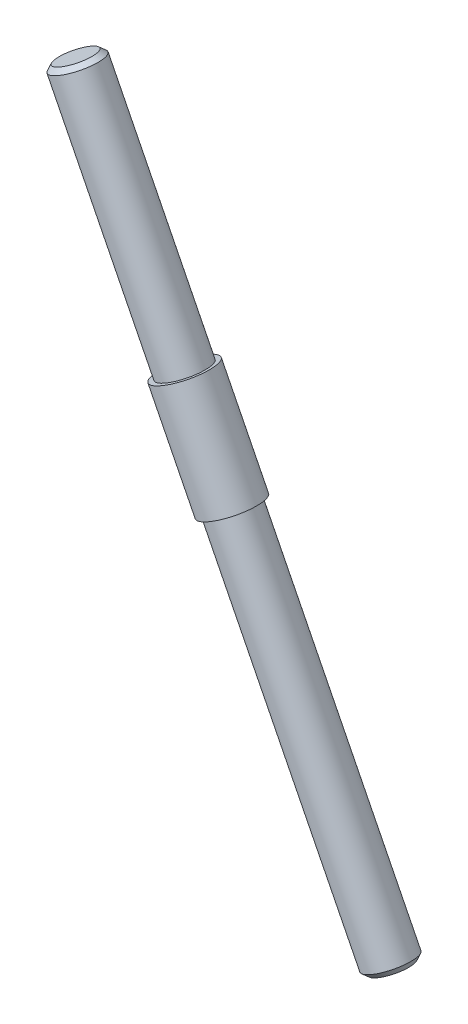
ISO-10303-21;
HEADER;
FILE_DESCRIPTION(('STEP AP214'),'2;1');
FILE_NAME('part.step','',(''),(''),'','','');
FILE_SCHEMA(('AUTOMOTIVE_DESIGN { 1 0 10303 214 1 1 1 1 }'));
ENDSEC;
DATA;
#1=APPLICATION_CONTEXT('core data for automotive mechanical design processes');
#2=APPLICATION_PROTOCOL_DEFINITION('international standard','automotive_design',2000,#1);
#3=PRODUCT_CONTEXT('',#1,'mechanical');
#4=PRODUCT('Part','Part','',(#3));
#5=PRODUCT_RELATED_PRODUCT_CATEGORY('part','',(#4));
#6=PRODUCT_DEFINITION_FORMATION('','',#4);
#7=PRODUCT_DEFINITION_CONTEXT('part definition',#1,'design');
#8=PRODUCT_DEFINITION('design','',#6,#7);
#9=PRODUCT_DEFINITION_SHAPE('','',#8);
#10=(LENGTH_UNIT() NAMED_UNIT(*) SI_UNIT(.MILLI.,.METRE.));
#11=(NAMED_UNIT(*) PLANE_ANGLE_UNIT() SI_UNIT($,.RADIAN.));
#12=(NAMED_UNIT(*) SI_UNIT($,.STERADIAN.) SOLID_ANGLE_UNIT());
#13=UNCERTAINTY_MEASURE_WITH_UNIT(LENGTH_MEASURE(1.E-05),#10,'distance_accuracy_value','');
#14=(GEOMETRIC_REPRESENTATION_CONTEXT(3) GLOBAL_UNCERTAINTY_ASSIGNED_CONTEXT((#13)) GLOBAL_UNIT_ASSIGNED_CONTEXT((#10,
#11,#12)) REPRESENTATION_CONTEXT('',''));
#15=CARTESIAN_POINT('',(0.,0.,0.));
#16=DIRECTION('',(0.,0.,1.));
#17=DIRECTION('',(1.,0.,0.));
#18=AXIS2_PLACEMENT_3D('',#15,#16,#17);
#19=CARTESIAN_POINT('',(15.2652376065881,52.1851188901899,0.));
#20=DIRECTION('',(0.449375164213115,-0.893343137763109,0.));
#21=DIRECTION('',(0.893343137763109,0.449375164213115,0.));
#22=AXIS2_PLACEMENT_3D('',#19,#20,#21);
#23=PLANE('',#22);
#24=CARTESIAN_POINT('',(13.0318797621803,51.0616809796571,0.));
#25=DIRECTION('',(0.449375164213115,-0.893343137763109,0.));
#26=DIRECTION('',(0.893343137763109,0.449375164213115,0.));
#27=AXIS2_PLACEMENT_3D('',#24,#25,#26);
#28=CIRCLE('',#27,2.00000000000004);
#29=CARTESIAN_POINT('',(14.8185660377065,51.9604313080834,0.));
#30=VERTEX_POINT('',#29);
#31=EDGE_CURVE('E381',#30,#30,#28,.T.);
#32=ORIENTED_EDGE('',*,*,#31,.T.);
#33=EDGE_LOOP('',(#32));
#34=FACE_BOUND('',#33,.T.);
#35=ADVANCED_FACE('F367',(#34),#23,.T.);
#36=CARTESIAN_POINT('',(-16.4021934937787,109.575656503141,0.));
#37=DIRECTION('',(0.449375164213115,-0.893343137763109,0.));
#38=DIRECTION('',(0.893343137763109,0.449375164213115,0.));
#39=AXIS2_PLACEMENT_3D('',#36,#37,#38);
#40=CYLINDRICAL_SURFACE('',#39,2.50000000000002);
#41=CARTESIAN_POINT('',(12.8071921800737,51.5083525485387,0.));
#42=DIRECTION('',(0.449375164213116,-0.893343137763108,0.));
#43=DIRECTION('',(0.893343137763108,0.449375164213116,0.));
#44=AXIS2_PLACEMENT_3D('',#41,#42,#43);
#45=CIRCLE('',#44,2.50000000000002);
#46=CARTESIAN_POINT('',(15.0405500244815,52.6317904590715,0.));
#47=VERTEX_POINT('',#46);
#48=EDGE_CURVE('E377',#47,#47,#45,.F.);
#49=ORIENTED_EDGE('',*,*,#48,.T.);
#50=EDGE_LOOP('',(#49));
#51=FACE_BOUND('',#50,.T.);
#52=CARTESIAN_POINT('',(-4.4937516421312,85.9020633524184,0.));
#53=DIRECTION('',(0.449375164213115,-0.893343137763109,0.));
#54=DIRECTION('',(0.893343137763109,0.449375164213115,0.));
#55=AXIS2_PLACEMENT_3D('',#52,#53,#54);
#56=CIRCLE('',#55,2.50000000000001);
#57=CARTESIAN_POINT('',(-2.26039379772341,87.0255012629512,0.));
#58=VERTEX_POINT('',#57);
#59=EDGE_CURVE('E386',#58,#58,#56,.T.);
#60=ORIENTED_EDGE('',*,*,#59,.T.);
#61=EDGE_LOOP('',(#60));
#62=FACE_BOUND('',#61,.T.);
#63=ADVANCED_FACE('F416',(#51,#62),#40,.T.);
#64=CARTESIAN_POINT('',(-1.81372222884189,87.2501888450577,0.));
#65=DIRECTION('',(0.449375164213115,-0.893343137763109,0.));
#66=DIRECTION('',(0.893343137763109,0.449375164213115,0.));
#67=AXIS2_PLACEMENT_3D('',#64,#65,#66);
#68=PLANE('',#67);
#69=CARTESIAN_POINT('',(-4.4937516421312,85.9020633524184,0.));
#70=DIRECTION('',(0.449375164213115,-0.893343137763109,0.));
#71=DIRECTION('',(0.893343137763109,0.449375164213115,0.));
#72=AXIS2_PLACEMENT_3D('',#69,#70,#71);
#73=CIRCLE('',#72,2.99999999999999);
#74=CARTESIAN_POINT('',(-1.81372222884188,87.2501888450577,0.));
#75=VERTEX_POINT('',#74);
#76=EDGE_CURVE('E389',#75,#75,#73,.T.);
#77=ORIENTED_EDGE('',*,*,#76,.T.);
#78=EDGE_LOOP('',(#77));
#79=FACE_BOUND('',#78,.T.);
#80=ORIENTED_EDGE('',*,*,#59,.F.);
#81=EDGE_LOOP('',(#80));
#82=FACE_BOUND('',#81,.T.);
#83=ADVANCED_FACE('F420',(#79,#82),#68,.T.);
#84=CARTESIAN_POINT('',(-16.4021934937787,109.575656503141,0.));
#85=DIRECTION('',(0.449375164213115,-0.893343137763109,0.));
#86=DIRECTION('',(0.893343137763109,0.449375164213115,0.));
#87=AXIS2_PLACEMENT_3D('',#84,#85,#86);
#88=CYLINDRICAL_SURFACE('',#87,3.00000000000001);
#89=CARTESIAN_POINT('',(-9.66156603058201,96.1755094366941,0.));
#90=DIRECTION('',(0.449375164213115,-0.893343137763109,0.));
#91=DIRECTION('',(0.893343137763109,0.449375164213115,0.));
#92=AXIS2_PLACEMENT_3D('',#89,#90,#91);
#93=CIRCLE('',#92,3.00000000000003);
#94=CARTESIAN_POINT('',(-6.98153661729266,97.5236349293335,0.));
#95=VERTEX_POINT('',#94);
#96=EDGE_CURVE('E392',#95,#95,#93,.T.);
#97=ORIENTED_EDGE('',*,*,#96,.T.);
#98=EDGE_LOOP('',(#97));
#99=FACE_BOUND('',#98,.T.);
#100=ORIENTED_EDGE('',*,*,#76,.F.);
#101=EDGE_LOOP('',(#100));
#102=FACE_BOUND('',#101,.T.);
#103=ADVANCED_FACE('F413',(#99,#102),#88,.T.);
#104=CARTESIAN_POINT('',(-7.42820818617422,97.2989473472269,0.));
#105=DIRECTION('',(-0.449375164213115,0.893343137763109,0.));
#106=DIRECTION('',(-0.893343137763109,-0.449375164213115,0.));
#107=AXIS2_PLACEMENT_3D('',#104,#105,#106);
#108=PLANE('',#107);
#109=CARTESIAN_POINT('',(-9.66156603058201,96.1755094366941,0.));
#110=DIRECTION('',(0.449375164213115,-0.893343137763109,0.));
#111=DIRECTION('',(0.893343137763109,0.449375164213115,0.));
#112=AXIS2_PLACEMENT_3D('',#109,#110,#111);
#113=CIRCLE('',#112,2.50000000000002);
#114=CARTESIAN_POINT('',(-7.42820818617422,97.2989473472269,0.));
#115=VERTEX_POINT('',#114);
#116=EDGE_CURVE('E395',#115,#115,#113,.T.);
#117=ORIENTED_EDGE('',*,*,#116,.T.);
#118=EDGE_LOOP('',(#117));
#119=FACE_BOUND('',#118,.T.);
#120=ORIENTED_EDGE('',*,*,#96,.F.);
#121=EDGE_LOOP('',(#120));
#122=FACE_BOUND('',#121,.T.);
#123=ADVANCED_FACE('F399',(#119,#122),#108,.T.);
#124=CARTESIAN_POINT('',(-16.4021934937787,109.575656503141,0.));
#125=DIRECTION('',(0.449375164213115,-0.893343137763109,0.));
#126=DIRECTION('',(0.893343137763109,0.449375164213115,0.));
#127=AXIS2_PLACEMENT_3D('',#124,#125,#126);
#128=CYLINDRICAL_SURFACE('',#127,2.49999999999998);
#129=CARTESIAN_POINT('',(-21.345320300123,119.402431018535,0.));
#130=DIRECTION('',(-0.449375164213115,0.893343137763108,0.));
#131=DIRECTION('',(-0.893343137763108,-0.449375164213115,0.));
#132=AXIS2_PLACEMENT_3D('',#129,#130,#131);
#133=CIRCLE('',#132,2.49999999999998);
#134=CARTESIAN_POINT('',(-23.5786781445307,118.278993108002,0.));
#135=VERTEX_POINT('',#134);
#136=EDGE_CURVE('E373',#135,#135,#133,.F.);
#137=ORIENTED_EDGE('',*,*,#136,.T.);
#138=EDGE_LOOP('',(#137));
#139=FACE_BOUND('',#138,.T.);
#140=ORIENTED_EDGE('',*,*,#116,.F.);
#141=EDGE_LOOP('',(#140));
#142=FACE_BOUND('',#141,.T.);
#143=ADVANCED_FACE('F402',(#139,#142),#128,.T.);
#144=CARTESIAN_POINT('',(-21.5700078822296,119.849102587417,0.));
#145=DIRECTION('',(-0.449375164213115,0.893343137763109,0.));
#146=DIRECTION('',(-0.893343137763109,-0.449375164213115,0.));
#147=AXIS2_PLACEMENT_3D('',#144,#145,#146);
#148=PLANE('',#147);
#149=CARTESIAN_POINT('',(-21.5700078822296,119.849102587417,0.));
#150=DIRECTION('',(-0.449375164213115,0.893343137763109,0.));
#151=DIRECTION('',(-0.893343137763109,-0.449375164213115,0.));
#152=AXIS2_PLACEMENT_3D('',#149,#150,#151);
#153=CIRCLE('',#152,1.99999999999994);
#154=CARTESIAN_POINT('',(-23.3566941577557,118.95035225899,0.));
#155=VERTEX_POINT('',#154);
#156=EDGE_CURVE('E10',#155,#155,#153,.T.);
#157=ORIENTED_EDGE('',*,*,#156,.T.);
#158=EDGE_LOOP('',(#157));
#159=FACE_BOUND('',#158,.T.);
#160=ADVANCED_FACE('F404',(#159),#148,.T.);
#161=CARTESIAN_POINT('',(13.0318797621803,51.0616809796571,0.));
#162=DIRECTION('',(-0.449375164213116,0.893343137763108,0.));
#163=DIRECTION('',(-0.893343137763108,-0.449375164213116,0.));
#164=AXIS2_PLACEMENT_3D('',#161,#162,#163);
#165=CONICAL_SURFACE('',#164,2.00000000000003,0.785398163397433);
#166=ORIENTED_EDGE('',*,*,#48,.F.);
#167=EDGE_LOOP('',(#166));
#168=FACE_BOUND('',#167,.T.);
#169=ORIENTED_EDGE('',*,*,#31,.F.);
#170=EDGE_LOOP('',(#169));
#171=FACE_BOUND('',#170,.T.);
#172=ADVANCED_FACE('F410',(#168,#171),#165,.T.);
#173=CARTESIAN_POINT('',(-21.345320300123,119.402431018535,0.));
#174=DIRECTION('',(0.449375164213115,-0.893343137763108,0.));
#175=DIRECTION('',(0.893343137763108,0.449375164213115,0.));
#176=AXIS2_PLACEMENT_3D('',#173,#174,#175);
#177=CONICAL_SURFACE('',#176,2.49999999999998,0.785398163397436);
#178=ORIENTED_EDGE('',*,*,#156,.F.);
#179=EDGE_LOOP('',(#178));
#180=FACE_BOUND('',#179,.T.);
#181=ORIENTED_EDGE('',*,*,#136,.F.);
#182=EDGE_LOOP('',(#181));
#183=FACE_BOUND('',#182,.T.);
#184=ADVANCED_FACE('F425',(#180,#183),#177,.T.);
#185=CLOSED_SHELL('',(#35,#63,#83,#103,#123,#143,#160,#172,#184));
#186=MANIFOLD_SOLID_BREP('B2',#185);
#187=ADVANCED_BREP_SHAPE_REPRESENTATION('',(#18,#186),#14);
#188=SHAPE_DEFINITION_REPRESENTATION(#9,#187);
ENDSEC;
END-ISO-10303-21;
